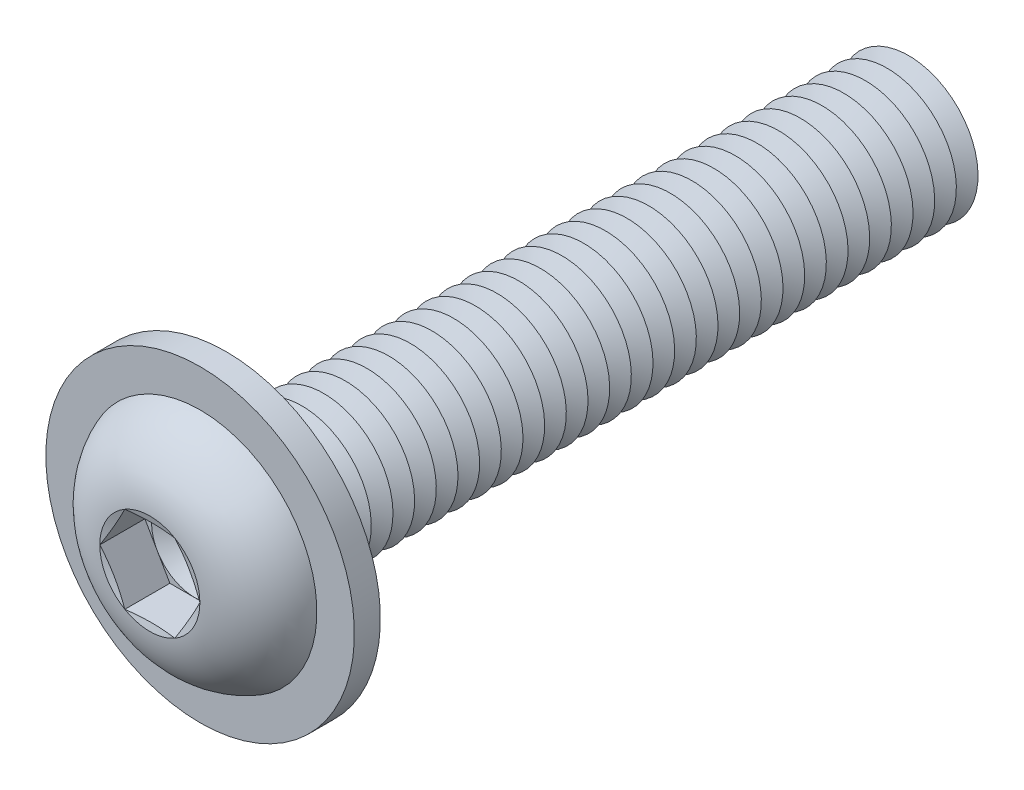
from build123d import *

# Parameters (mm, degrees)
FILLET1_R           = 0.625
LPATTERN1_COUNT     = 32
LPATTERN1_PITCH     = 1.25
CUT_EXTRUDE1_DEPTH  = 2.6
SKETCH5_R           = 8.9
SKETCH5_R_2         = 4.625
BOSS_EXTRUDE1_DEPTH = 1.5


with BuildPart() as part:
    # Sketch1 → Revolve1 (revolve)
    with BuildSketch(Plane(origin=(0, 0, 0), x_dir=(0, 0, -1), z_dir=(1, 0, 0))):
        with BuildLine():
            Line((0, 4), (0, 7))
            ThreePointArc((0, 7), (-3.011595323, 5.81154966), (-4.4, 2.88675))
            Line((-4.4, 2.88675), (-4.013248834, 1.443375))
            Line((-4.013248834, 1.443375), (-4.4, 1.443375))
            Line((-4.4, 1.443375), (-4.4, 0))
            Line((-4.4, 0), (40, 0))
            Line((40, 0), (40, 4))
            Line((40, 4), (0, 4))
        make_face()
    revolve(axis=Axis((0, 0, -40), (0, 0, 1)))

    # Fillet1
    fillet1_edges = [part.edges().sort_by_distance(p)[0] for p in [
        (0, -4, 0),
    ]]
    fillet(fillet1_edges, radius=FILLET1_R)

    # Sketch2 → Cut-Revolve1 (revolve, cut)
    with BuildSketch(Plane(origin=(0, 0, 0), x_dir=(0, 0, -1), z_dir=(1, 0, 0))):
        Polygon((39.375, 4), (40.625, 4), (40, 2.917468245), align=None)
    cut_revolve1 = revolve(axis=Axis((0, 0, -40), (0, 0, -1)), mode=Mode.SUBTRACT)

    # LPattern1: Cut-Revolve1 ×32
    with Locations(*[(0, 0, i * LPATTERN1_PITCH) for i in range(1, LPATTERN1_COUNT)]):
        add(cut_revolve1, mode=Mode.SUBTRACT)

    # Sketch3 → Cut-Extrude1 (cut)
    with BuildSketch(Plane.XY.offset(4.4)):
        Polygon((1.443375, 2.499998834), (-1.443375, 2.499998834), (-2.88675, 0), (-1.443375, -2.499998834), (1.443375, -2.499998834), (2.88675, 0), align=None)
    extrude(amount=-CUT_EXTRUDE1_DEPTH, mode=Mode.SUBTRACT)

    # Cut-Extrude2 cone 1 section (on through the dimple's axis) → Cut-Extrude2 (revolve, cut)
    with BuildSketch(Plane(origin=(0, 0, 1.8), x_dir=(0, -1, 0), z_dir=(1, 0, 0))):
        Polygon((0, 0), (2.499998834, 0), (0, 1.443375), align=None)
    revolve(axis=Axis((0, 0, 1.8), (0, 0, -1)), mode=Mode.SUBTRACT)

    # Sketch5 → Boss-Extrude1 (add)
    with BuildSketch(Plane(origin=(0, 0, 0), x_dir=(-1, 0, 0), z_dir=(0, 0, -1))):
        with Locations(Location((0, 0, 0), (0, 0, 90))):
            Circle(SKETCH5_R)
        Circle(SKETCH5_R_2, mode=Mode.SUBTRACT)
    extrude(amount=-BOSS_EXTRUDE1_DEPTH)


solid = part.part
